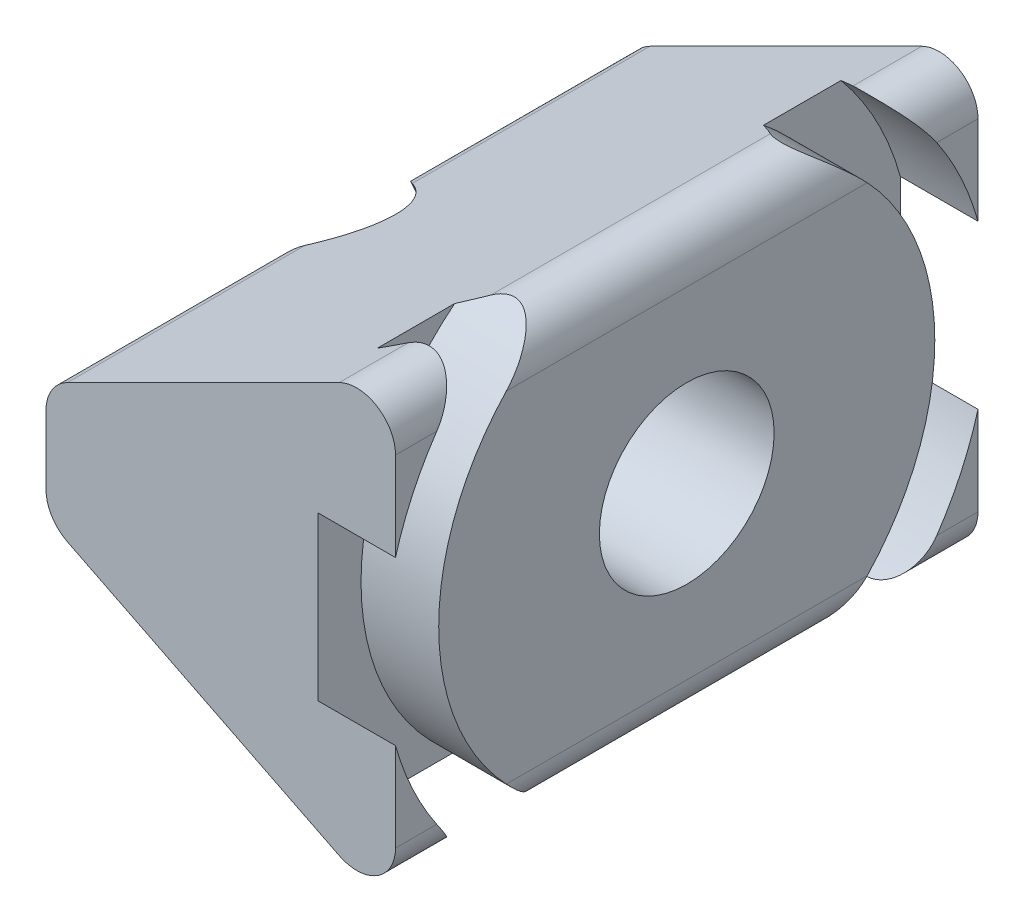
from build123d import *

# Parameters (mm, degrees)
EXTRUSION1_DEPTH        = 15
CONG_2_R                = 1
ESQUISSE3_R             = 7.78747599
ESQUISSE3_R_2           = 6.38747599
ENL_V_MAT_EXTRU_2_DEPTH = 2
ESQUISSE4_R             = 2.25
ENL_V_MAT_EXTRU_3_DEPTH = 19.302064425


with BuildPart() as part:
    # Esquisse1 → Extrusion1 (new body)
    with BuildSketch(Plane.XY):
        Polygon((-9, 0), (-9, 1.5), (0, 6), (0, 0), align=None)
    extrusion1 = extrude(amount=EXTRUSION1_DEPTH)

    # Sym_trie1: Extrusion1 across plane
    add(extrusion1.mirror(Plane(origin=(0, 0, 15), x_dir=(0, 0, 1), z_dir=(0, 1, 0))))

    # Cong_2
    cong_2_edges = [part.edges().sort_by_distance(p)[0] for p in [
        (-9, -1.5, 7.5),
        (0, -6, 7.5),
        (-9, 1.5, 7.5),
        (0, 6, 7.5),
    ]]
    fillet(cong_2_edges, radius=CONG_2_R)

    # Esquisse3 → Enl_v. mat.-Extru.2 (cut)
    with BuildSketch(Plane(origin=(0, 0, 0), x_dir=(0, 0, -1), z_dir=(1, 0, 0))):
        with Locations((-7.5, 0)):
            Circle(ESQUISSE3_R)
        with Locations((-7.5, 0)):
            Circle(ESQUISSE3_R_2, mode=Mode.SUBTRACT)
    extrude(amount=-ENL_V_MAT_EXTRU_2_DEPTH, mode=Mode.SUBTRACT)

    # Esquisse4 → Enl_v. mat.-Extru.3 (cut, through all)
    with BuildSketch(Plane(origin=(0, 0, 0), x_dir=(0, 0, -1), z_dir=(1, 0, 0))):
        with Locations(Location((-7.5, 0, 0), (0, 0, 90))):
            Circle(ESQUISSE4_R)
    extrude(amount=-ENL_V_MAT_EXTRU_3_DEPTH, mode=Mode.SUBTRACT)


solid = part.part
